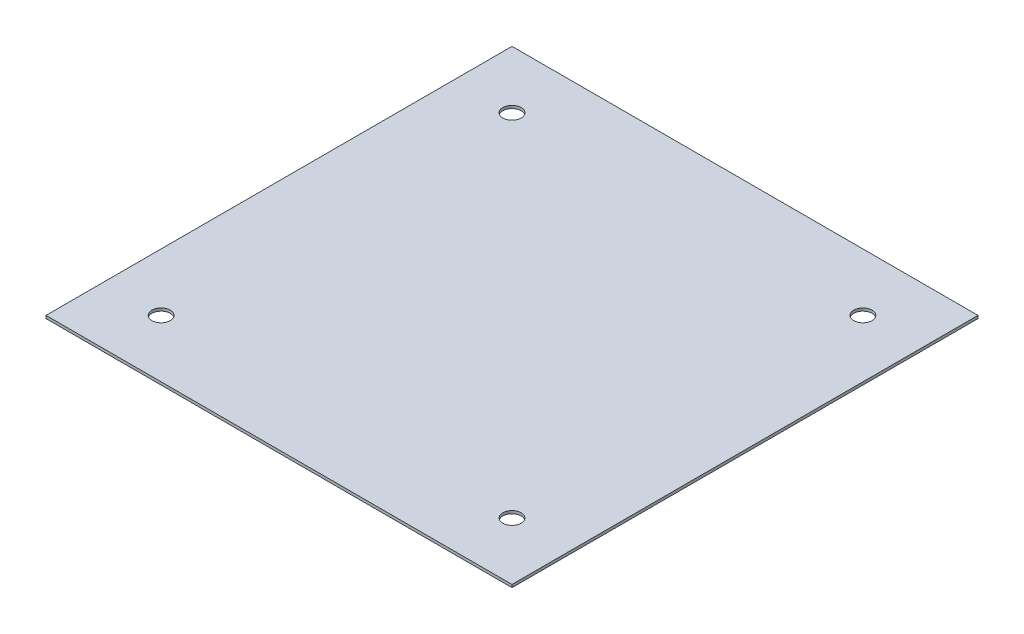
ISO-10303-21;
HEADER;
FILE_DESCRIPTION(('STEP AP214'),'2;1');
FILE_NAME('part.step','',(''),(''),'','','');
FILE_SCHEMA(('AUTOMOTIVE_DESIGN { 1 0 10303 214 1 1 1 1 }'));
ENDSEC;
DATA;
#1=APPLICATION_CONTEXT('core data for automotive mechanical design processes');
#2=APPLICATION_PROTOCOL_DEFINITION('international standard','automotive_design',2000,#1);
#3=PRODUCT_CONTEXT('',#1,'mechanical');
#4=PRODUCT('Part','Part','',(#3));
#5=PRODUCT_RELATED_PRODUCT_CATEGORY('part','',(#4));
#6=PRODUCT_DEFINITION_FORMATION('','',#4);
#7=PRODUCT_DEFINITION_CONTEXT('part definition',#1,'design');
#8=PRODUCT_DEFINITION('design','',#6,#7);
#9=PRODUCT_DEFINITION_SHAPE('','',#8);
#10=(LENGTH_UNIT() NAMED_UNIT(*) SI_UNIT(.MILLI.,.METRE.));
#11=(NAMED_UNIT(*) PLANE_ANGLE_UNIT() SI_UNIT($,.RADIAN.));
#12=(NAMED_UNIT(*) SI_UNIT($,.STERADIAN.) SOLID_ANGLE_UNIT());
#13=UNCERTAINTY_MEASURE_WITH_UNIT(LENGTH_MEASURE(1.E-05),#10,'distance_accuracy_value','');
#14=(GEOMETRIC_REPRESENTATION_CONTEXT(3) GLOBAL_UNCERTAINTY_ASSIGNED_CONTEXT((#13)) GLOBAL_UNIT_ASSIGNED_CONTEXT((#10,
#11,#12)) REPRESENTATION_CONTEXT('',''));
#15=CARTESIAN_POINT('',(0.,0.,0.));
#16=DIRECTION('',(0.,0.,1.));
#17=DIRECTION('',(1.,0.,0.));
#18=AXIS2_PLACEMENT_3D('',#15,#16,#17);
#19=CARTESIAN_POINT('',(0.,2.,0.));
#20=DIRECTION('',(0.,1.,0.));
#21=DIRECTION('',(0.,0.,1.));
#22=AXIS2_PLACEMENT_3D('',#19,#20,#21);
#23=PLANE('',#22);
#24=CARTESIAN_POINT('',(124.999999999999,2.,125.000000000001));
#25=DIRECTION('',(0.,1.,0.));
#26=DIRECTION('',(0.,0.,1.));
#27=AXIS2_PLACEMENT_3D('',#24,#25,#26);
#28=CIRCLE('',#27,6.50000000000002);
#29=CARTESIAN_POINT('',(124.999999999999,2.,131.500000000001));
#30=VERTEX_POINT('',#29);
#31=EDGE_CURVE('E120',#30,#30,#28,.T.);
#32=ORIENTED_EDGE('',*,*,#31,.F.);
#33=EDGE_LOOP('',(#32));
#34=FACE_BOUND('',#33,.T.);
#35=CARTESIAN_POINT('',(-125.,2.,-125.));
#36=DIRECTION('',(0.,1.,0.));
#37=DIRECTION('',(0.,0.,1.));
#38=AXIS2_PLACEMENT_3D('',#35,#36,#37);
#39=CIRCLE('',#38,6.5);
#40=CARTESIAN_POINT('',(-125.,2.,-118.5));
#41=VERTEX_POINT('',#40);
#42=EDGE_CURVE('E99',#41,#41,#39,.T.);
#43=ORIENTED_EDGE('',*,*,#42,.F.);
#44=EDGE_LOOP('',(#43));
#45=FACE_BOUND('',#44,.T.);
#46=DIRECTION('',(0.,0.,-1.));
#47=VECTOR('',#46,1.);
#48=CARTESIAN_POINT('',(166.,2.,-166.));
#49=LINE('',#48,#47);
#50=CARTESIAN_POINT('',(166.,2.,166.));
#51=VERTEX_POINT('',#50);
#52=CARTESIAN_POINT('',(166.,2.,-166.));
#53=VERTEX_POINT('',#52);
#54=EDGE_CURVE('E84',#51,#53,#49,.T.);
#55=ORIENTED_EDGE('',*,*,#54,.T.);
#56=DIRECTION('',(-1.,0.,0.));
#57=VECTOR('',#56,1.);
#58=CARTESIAN_POINT('',(-166.,2.,-166.));
#59=LINE('',#58,#57);
#60=CARTESIAN_POINT('',(-166.,2.,-166.));
#61=VERTEX_POINT('',#60);
#62=EDGE_CURVE('E79',#53,#61,#59,.T.);
#63=ORIENTED_EDGE('',*,*,#62,.T.);
#64=DIRECTION('',(0.,0.,1.));
#65=VECTOR('',#64,1.);
#66=CARTESIAN_POINT('',(-166.,2.,-166.));
#67=LINE('',#66,#65);
#68=CARTESIAN_POINT('',(-166.,2.,166.));
#69=VERTEX_POINT('',#68);
#70=EDGE_CURVE('E82',#61,#69,#67,.T.);
#71=ORIENTED_EDGE('',*,*,#70,.T.);
#72=DIRECTION('',(1.,0.,0.));
#73=VECTOR('',#72,1.);
#74=CARTESIAN_POINT('',(-166.,2.,166.));
#75=LINE('',#74,#73);
#76=EDGE_CURVE('E49',#69,#51,#75,.T.);
#77=ORIENTED_EDGE('',*,*,#76,.T.);
#78=EDGE_LOOP('',(#55,#63,#71,#77));
#79=FACE_BOUND('',#78,.T.);
#80=CARTESIAN_POINT('',(124.999999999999,2.,-125.000000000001));
#81=DIRECTION('',(0.,1.,0.));
#82=DIRECTION('',(0.,0.,-1.));
#83=AXIS2_PLACEMENT_3D('',#80,#81,#82);
#84=CIRCLE('',#83,6.50000000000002);
#85=CARTESIAN_POINT('',(124.999999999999,2.,-131.500000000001));
#86=VERTEX_POINT('',#85);
#87=EDGE_CURVE('E114',#86,#86,#84,.T.);
#88=ORIENTED_EDGE('',*,*,#87,.F.);
#89=EDGE_LOOP('',(#88));
#90=FACE_BOUND('',#89,.T.);
#91=CARTESIAN_POINT('',(-125.,2.,125.));
#92=DIRECTION('',(0.,1.,0.));
#93=DIRECTION('',(0.,0.,-1.));
#94=AXIS2_PLACEMENT_3D('',#91,#92,#93);
#95=CIRCLE('',#94,6.5);
#96=CARTESIAN_POINT('',(-125.,2.,118.5));
#97=VERTEX_POINT('',#96);
#98=EDGE_CURVE('E126',#97,#97,#95,.T.);
#99=ORIENTED_EDGE('',*,*,#98,.F.);
#100=EDGE_LOOP('',(#99));
#101=FACE_BOUND('',#100,.T.);
#102=ADVANCED_FACE('F32',(#34,#45,#79,#90,#101),#23,.T.);
#103=CARTESIAN_POINT('',(0.,0.,0.));
#104=DIRECTION('',(0.,1.,0.));
#105=DIRECTION('',(0.,0.,1.));
#106=AXIS2_PLACEMENT_3D('',#103,#104,#105);
#107=PLANE('',#106);
#108=DIRECTION('',(0.,0.,-1.));
#109=VECTOR('',#108,1.);
#110=CARTESIAN_POINT('',(166.,0.,-166.));
#111=LINE('',#110,#109);
#112=CARTESIAN_POINT('',(166.,0.,166.));
#113=VERTEX_POINT('',#112);
#114=CARTESIAN_POINT('',(166.,0.,-166.));
#115=VERTEX_POINT('',#114);
#116=EDGE_CURVE('E96',#113,#115,#111,.T.);
#117=ORIENTED_EDGE('',*,*,#116,.F.);
#118=DIRECTION('',(1.,0.,0.));
#119=VECTOR('',#118,1.);
#120=CARTESIAN_POINT('',(-166.,0.,166.));
#121=LINE('',#120,#119);
#122=CARTESIAN_POINT('',(-166.,0.,166.));
#123=VERTEX_POINT('',#122);
#124=EDGE_CURVE('E72',#123,#113,#121,.T.);
#125=ORIENTED_EDGE('',*,*,#124,.F.);
#126=DIRECTION('',(0.,0.,1.));
#127=VECTOR('',#126,1.);
#128=CARTESIAN_POINT('',(-166.,0.,-166.));
#129=LINE('',#128,#127);
#130=CARTESIAN_POINT('',(-166.,0.,-166.));
#131=VERTEX_POINT('',#130);
#132=EDGE_CURVE('E66',#131,#123,#129,.T.);
#133=ORIENTED_EDGE('',*,*,#132,.F.);
#134=DIRECTION('',(-1.,0.,0.));
#135=VECTOR('',#134,1.);
#136=CARTESIAN_POINT('',(-166.,0.,-166.));
#137=LINE('',#136,#135);
#138=EDGE_CURVE('E88',#115,#131,#137,.T.);
#139=ORIENTED_EDGE('',*,*,#138,.F.);
#140=EDGE_LOOP('',(#117,#125,#133,#139));
#141=FACE_BOUND('',#140,.T.);
#142=CARTESIAN_POINT('',(-125.,0.,-125.));
#143=DIRECTION('',(0.,1.,0.));
#144=DIRECTION('',(0.,0.,1.));
#145=AXIS2_PLACEMENT_3D('',#142,#143,#144);
#146=CIRCLE('',#145,6.5);
#147=CARTESIAN_POINT('',(-125.,0.,-118.5));
#148=VERTEX_POINT('',#147);
#149=EDGE_CURVE('E111',#148,#148,#146,.T.);
#150=ORIENTED_EDGE('',*,*,#149,.T.);
#151=EDGE_LOOP('',(#150));
#152=FACE_BOUND('',#151,.T.);
#153=CARTESIAN_POINT('',(124.999999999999,0.,-125.000000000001));
#154=DIRECTION('',(0.,1.,0.));
#155=DIRECTION('',(0.,0.,-1.));
#156=AXIS2_PLACEMENT_3D('',#153,#154,#155);
#157=CIRCLE('',#156,6.50000000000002);
#158=CARTESIAN_POINT('',(124.999999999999,0.,-131.500000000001));
#159=VERTEX_POINT('',#158);
#160=EDGE_CURVE('E117',#159,#159,#157,.T.);
#161=ORIENTED_EDGE('',*,*,#160,.T.);
#162=EDGE_LOOP('',(#161));
#163=FACE_BOUND('',#162,.T.);
#164=CARTESIAN_POINT('',(124.999999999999,0.,125.000000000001));
#165=DIRECTION('',(0.,1.,0.));
#166=DIRECTION('',(0.,0.,1.));
#167=AXIS2_PLACEMENT_3D('',#164,#165,#166);
#168=CIRCLE('',#167,6.50000000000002);
#169=CARTESIAN_POINT('',(124.999999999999,0.,131.500000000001));
#170=VERTEX_POINT('',#169);
#171=EDGE_CURVE('E123',#170,#170,#168,.T.);
#172=ORIENTED_EDGE('',*,*,#171,.T.);
#173=EDGE_LOOP('',(#172));
#174=FACE_BOUND('',#173,.T.);
#175=CARTESIAN_POINT('',(-125.,0.,125.));
#176=DIRECTION('',(0.,1.,0.));
#177=DIRECTION('',(0.,0.,-1.));
#178=AXIS2_PLACEMENT_3D('',#175,#176,#177);
#179=CIRCLE('',#178,6.5);
#180=CARTESIAN_POINT('',(-125.,0.,118.5));
#181=VERTEX_POINT('',#180);
#182=EDGE_CURVE('E129',#181,#181,#179,.T.);
#183=ORIENTED_EDGE('',*,*,#182,.T.);
#184=EDGE_LOOP('',(#183));
#185=FACE_BOUND('',#184,.T.);
#186=ADVANCED_FACE('F107',(#141,#152,#163,#174,#185),#107,.F.);
#187=CARTESIAN_POINT('',(166.,2.,-166.));
#188=DIRECTION('',(-1.,0.,0.));
#189=DIRECTION('',(0.,0.,1.));
#190=AXIS2_PLACEMENT_3D('',#187,#188,#189);
#191=PLANE('',#190);
#192=ORIENTED_EDGE('',*,*,#116,.T.);
#193=DIRECTION('',(0.,-1.,0.));
#194=VECTOR('',#193,1.);
#195=CARTESIAN_POINT('',(166.,2.,-166.));
#196=LINE('',#195,#194);
#197=EDGE_CURVE('E11',#53,#115,#196,.T.);
#198=ORIENTED_EDGE('',*,*,#197,.F.);
#199=ORIENTED_EDGE('',*,*,#54,.F.);
#200=DIRECTION('',(0.,-1.,0.));
#201=VECTOR('',#200,1.);
#202=CARTESIAN_POINT('',(166.,2.,166.));
#203=LINE('',#202,#201);
#204=EDGE_CURVE('E92',#51,#113,#203,.T.);
#205=ORIENTED_EDGE('',*,*,#204,.T.);
#206=EDGE_LOOP('',(#192,#198,#199,#205));
#207=FACE_BOUND('',#206,.T.);
#208=ADVANCED_FACE('F34',(#207),#191,.F.);
#209=CARTESIAN_POINT('',(-166.,2.,-166.));
#210=DIRECTION('',(0.,0.,1.));
#211=DIRECTION('',(1.,0.,0.));
#212=AXIS2_PLACEMENT_3D('',#209,#210,#211);
#213=PLANE('',#212);
#214=ORIENTED_EDGE('',*,*,#138,.T.);
#215=DIRECTION('',(0.,-1.,0.));
#216=VECTOR('',#215,1.);
#217=CARTESIAN_POINT('',(-166.,2.,-166.));
#218=LINE('',#217,#216);
#219=EDGE_CURVE('E41',#61,#131,#218,.T.);
#220=ORIENTED_EDGE('',*,*,#219,.F.);
#221=ORIENTED_EDGE('',*,*,#62,.F.);
#222=ORIENTED_EDGE('',*,*,#197,.T.);
#223=EDGE_LOOP('',(#214,#220,#221,#222));
#224=FACE_BOUND('',#223,.T.);
#225=ADVANCED_FACE('F87',(#224),#213,.F.);
#226=CARTESIAN_POINT('',(-166.,2.,-166.));
#227=DIRECTION('',(1.,0.,0.));
#228=DIRECTION('',(0.,0.,-1.));
#229=AXIS2_PLACEMENT_3D('',#226,#227,#228);
#230=PLANE('',#229);
#231=ORIENTED_EDGE('',*,*,#132,.T.);
#232=DIRECTION('',(0.,-1.,0.));
#233=VECTOR('',#232,1.);
#234=CARTESIAN_POINT('',(-166.,2.,166.));
#235=LINE('',#234,#233);
#236=EDGE_CURVE('E89',#69,#123,#235,.T.);
#237=ORIENTED_EDGE('',*,*,#236,.F.);
#238=ORIENTED_EDGE('',*,*,#70,.F.);
#239=ORIENTED_EDGE('',*,*,#219,.T.);
#240=EDGE_LOOP('',(#231,#237,#238,#239));
#241=FACE_BOUND('',#240,.T.);
#242=ADVANCED_FACE('F90',(#241),#230,.F.);
#243=CARTESIAN_POINT('',(-166.,2.,166.));
#244=DIRECTION('',(0.,0.,-1.));
#245=DIRECTION('',(-1.,0.,0.));
#246=AXIS2_PLACEMENT_3D('',#243,#244,#245);
#247=PLANE('',#246);
#248=ORIENTED_EDGE('',*,*,#124,.T.);
#249=ORIENTED_EDGE('',*,*,#204,.F.);
#250=ORIENTED_EDGE('',*,*,#76,.F.);
#251=ORIENTED_EDGE('',*,*,#236,.T.);
#252=EDGE_LOOP('',(#248,#249,#250,#251));
#253=FACE_BOUND('',#252,.T.);
#254=ADVANCED_FACE('F104',(#253),#247,.F.);
#255=CARTESIAN_POINT('',(-125.,2.,-125.));
#256=DIRECTION('',(0.,-1.,0.));
#257=DIRECTION('',(0.,0.,-1.));
#258=AXIS2_PLACEMENT_3D('',#255,#256,#257);
#259=CYLINDRICAL_SURFACE('',#258,6.5);
#260=ORIENTED_EDGE('',*,*,#42,.T.);
#261=EDGE_LOOP('',(#260));
#262=FACE_BOUND('',#261,.T.);
#263=ORIENTED_EDGE('',*,*,#149,.F.);
#264=EDGE_LOOP('',(#263));
#265=FACE_BOUND('',#264,.T.);
#266=ADVANCED_FACE('F148',(#262,#265),#259,.F.);
#267=CARTESIAN_POINT('',(124.999999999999,2.,-125.000000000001));
#268=DIRECTION('',(0.,-1.,0.));
#269=DIRECTION('',(0.,0.,-1.));
#270=AXIS2_PLACEMENT_3D('',#267,#268,#269);
#271=CYLINDRICAL_SURFACE('',#270,6.50000000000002);
#272=ORIENTED_EDGE('',*,*,#87,.T.);
#273=EDGE_LOOP('',(#272));
#274=FACE_BOUND('',#273,.T.);
#275=ORIENTED_EDGE('',*,*,#160,.F.);
#276=EDGE_LOOP('',(#275));
#277=FACE_BOUND('',#276,.T.);
#278=ADVANCED_FACE('F194',(#274,#277),#271,.F.);
#279=CARTESIAN_POINT('',(124.999999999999,2.,125.000000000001));
#280=DIRECTION('',(0.,-1.,0.));
#281=DIRECTION('',(0.,0.,-1.));
#282=AXIS2_PLACEMENT_3D('',#279,#280,#281);
#283=CYLINDRICAL_SURFACE('',#282,6.50000000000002);
#284=ORIENTED_EDGE('',*,*,#31,.T.);
#285=EDGE_LOOP('',(#284));
#286=FACE_BOUND('',#285,.T.);
#287=ORIENTED_EDGE('',*,*,#171,.F.);
#288=EDGE_LOOP('',(#287));
#289=FACE_BOUND('',#288,.T.);
#290=ADVANCED_FACE('F202',(#286,#289),#283,.F.);
#291=CARTESIAN_POINT('',(-125.,2.,125.));
#292=DIRECTION('',(0.,-1.,0.));
#293=DIRECTION('',(0.,0.,-1.));
#294=AXIS2_PLACEMENT_3D('',#291,#292,#293);
#295=CYLINDRICAL_SURFACE('',#294,6.5);
#296=ORIENTED_EDGE('',*,*,#98,.T.);
#297=EDGE_LOOP('',(#296));
#298=FACE_BOUND('',#297,.T.);
#299=ORIENTED_EDGE('',*,*,#182,.F.);
#300=EDGE_LOOP('',(#299));
#301=FACE_BOUND('',#300,.T.);
#302=ADVANCED_FACE('F135',(#298,#301),#295,.F.);
#303=CLOSED_SHELL('',(#102,#186,#208,#225,#242,#254,#266,#278,#290,#302));
#304=MANIFOLD_SOLID_BREP('B2',#303);
#305=ADVANCED_BREP_SHAPE_REPRESENTATION('',(#18,#304),#14);
#306=SHAPE_DEFINITION_REPRESENTATION(#9,#305);
ENDSEC;
END-ISO-10303-21;
